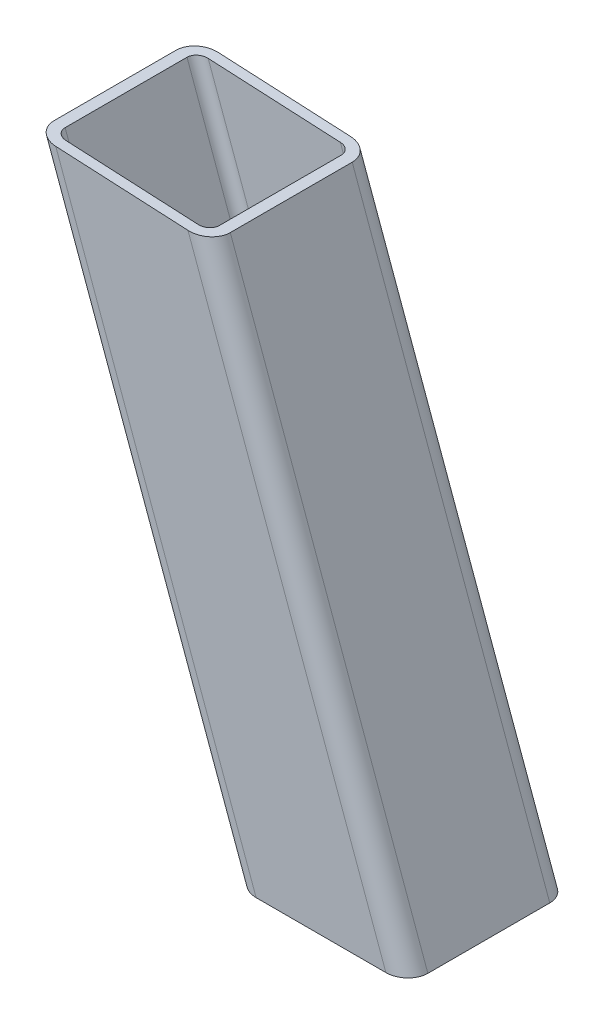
ISO-10303-21;
HEADER;
FILE_DESCRIPTION(('STEP AP214'),'2;1');
FILE_NAME('part.step','',(''),(''),'','','');
FILE_SCHEMA(('AUTOMOTIVE_DESIGN { 1 0 10303 214 1 1 1 1 }'));
ENDSEC;
DATA;
#1=APPLICATION_CONTEXT('core data for automotive mechanical design processes');
#2=APPLICATION_PROTOCOL_DEFINITION('international standard','automotive_design',2000,#1);
#3=PRODUCT_CONTEXT('',#1,'mechanical');
#4=PRODUCT('Part','Part','',(#3));
#5=PRODUCT_RELATED_PRODUCT_CATEGORY('part','',(#4));
#6=PRODUCT_DEFINITION_FORMATION('','',#4);
#7=PRODUCT_DEFINITION_CONTEXT('part definition',#1,'design');
#8=PRODUCT_DEFINITION('design','',#6,#7);
#9=PRODUCT_DEFINITION_SHAPE('','',#8);
#10=(LENGTH_UNIT() NAMED_UNIT(*) SI_UNIT(.MILLI.,.METRE.));
#11=(NAMED_UNIT(*) PLANE_ANGLE_UNIT() SI_UNIT($,.RADIAN.));
#12=(NAMED_UNIT(*) SI_UNIT($,.STERADIAN.) SOLID_ANGLE_UNIT());
#13=UNCERTAINTY_MEASURE_WITH_UNIT(LENGTH_MEASURE(1.E-05),#10,'distance_accuracy_value','');
#14=(GEOMETRIC_REPRESENTATION_CONTEXT(3) GLOBAL_UNCERTAINTY_ASSIGNED_CONTEXT((#13)) GLOBAL_UNIT_ASSIGNED_CONTEXT((#10,
#11,#12)) REPRESENTATION_CONTEXT('',''));
#15=CARTESIAN_POINT('',(0.,0.,0.));
#16=DIRECTION('',(0.,0.,1.));
#17=DIRECTION('',(1.,0.,0.));
#18=AXIS2_PLACEMENT_3D('',#15,#16,#17);
#19=CARTESIAN_POINT('',(937.587704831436,13.6808057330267,30.));
#20=DIRECTION('',(-0.939692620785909,-0.342020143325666,0.));
#21=DIRECTION('',(0.342020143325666,-0.939692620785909,0.));
#22=AXIS2_PLACEMENT_3D('',#19,#20,#21);
#23=PLANE('',#22);
#24=DIRECTION('',(0.,0.,1.));
#25=VECTOR('',#24,1.);
#26=CARTESIAN_POINT('',(921.820807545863,56.9999999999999,30.0000000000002));
#27=LINE('',#26,#25);
#28=CARTESIAN_POINT('',(921.820807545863,57.0000000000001,-30.));
#29=VERTEX_POINT('',#28);
#30=CARTESIAN_POINT('',(921.820807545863,56.9999999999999,30.));
#31=VERTEX_POINT('',#30);
#32=EDGE_CURVE('E53',#29,#31,#27,.T.);
#33=ORIENTED_EDGE('',*,*,#32,.F.);
#34=DIRECTION('',(-0.342020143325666,0.939692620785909,0.));
#35=VECTOR('',#34,1.);
#36=CARTESIAN_POINT('',(937.587704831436,13.6808057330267,-30.));
#37=LINE('',#36,#35);
#38=CARTESIAN_POINT('',(824.604054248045,324.100834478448,-30.));
#39=VERTEX_POINT('',#38);
#40=EDGE_CURVE('E38',#29,#39,#37,.T.);
#41=ORIENTED_EDGE('',*,*,#40,.T.);
#42=DIRECTION('',(0.,0.,-1.));
#43=VECTOR('',#42,1.);
#44=CARTESIAN_POINT('',(824.604054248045,324.100834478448,30.));
#45=LINE('',#44,#43);
#46=CARTESIAN_POINT('',(824.604054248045,324.100834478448,30.));
#47=VERTEX_POINT('',#46);
#48=EDGE_CURVE('E107',#47,#39,#45,.T.);
#49=ORIENTED_EDGE('',*,*,#48,.F.);
#50=DIRECTION('',(-0.342020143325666,0.939692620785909,0.));
#51=VECTOR('',#50,1.);
#52=CARTESIAN_POINT('',(937.587704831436,13.6808057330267,30.));
#53=LINE('',#52,#51);
#54=EDGE_CURVE('E185',#31,#47,#53,.T.);
#55=ORIENTED_EDGE('',*,*,#54,.F.);
#56=EDGE_LOOP('',(#33,#41,#49,#55));
#57=FACE_BOUND('',#56,.T.);
#58=ADVANCED_FACE('F34',(#57),#23,.F.);
#59=CARTESIAN_POINT('',(928.190778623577,10.26060429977,-30.));
#60=DIRECTION('',(-0.342020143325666,0.939692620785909,0.));
#61=DIRECTION('',(-0.939692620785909,-0.342020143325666,0.));
#62=AXIS2_PLACEMENT_3D('',#59,#60,#61);
#63=CYLINDRICAL_SURFACE('',#62,10.);
#64=CARTESIAN_POINT('',(911.179029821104,57.0000000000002,-30.));
#65=DIRECTION('',(0.,-1.,0.));
#66=DIRECTION('',(-1.,0.,0.));
#67=AXIS2_PLACEMENT_3D('',#64,#65,#66);
#68=ELLIPSE('',#67,10.6417777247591,10.);
#69=CARTESIAN_POINT('',(911.179029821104,57.0000000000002,-40.));
#70=VERTEX_POINT('',#69);
#71=EDGE_CURVE('E155',#70,#29,#68,.T.);
#72=ORIENTED_EDGE('',*,*,#71,.F.);
#73=DIRECTION('',(-0.342020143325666,0.939692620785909,0.));
#74=VECTOR('',#73,1.);
#75=CARTESIAN_POINT('',(928.190778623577,10.26060429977,-40.));
#76=LINE('',#75,#74);
#77=CARTESIAN_POINT('',(813.764747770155,324.643540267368,-40.));
#78=VERTEX_POINT('',#77);
#79=EDGE_CURVE('E165',#70,#78,#76,.T.);
#80=ORIENTED_EDGE('',*,*,#79,.T.);
#81=CARTESIAN_POINT('',(813.764747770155,324.643540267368,-30.));
#82=DIRECTION('',(0.0500056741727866,0.998748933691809,0.));
#83=DIRECTION('',(-0.998748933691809,0.0500056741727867,0.));
#84=AXIS2_PLACEMENT_3D('',#81,#82,#83);
#85=ELLIPSE('',#84,10.8528841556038,10.);
#86=EDGE_CURVE('E102',#39,#78,#85,.T.);
#87=ORIENTED_EDGE('',*,*,#86,.F.);
#88=ORIENTED_EDGE('',*,*,#40,.F.);
#89=EDGE_LOOP('',(#72,#80,#87,#88));
#90=FACE_BOUND('',#89,.T.);
#91=ADVANCED_FACE('F164',(#90),#63,.T.);
#92=CARTESIAN_POINT('',(871.809221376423,-10.26060429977,-40.));
#93=DIRECTION('',(0.,0.,1.));
#94=DIRECTION('',(1.,0.,0.));
#95=AXIS2_PLACEMENT_3D('',#92,#93,#94);
#96=PLANE('',#95);
#97=DIRECTION('',(1.,0.,0.));
#98=VECTOR('',#97,1.);
#99=CARTESIAN_POINT('',(871.809221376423,57.0000000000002,-40.));
#100=LINE('',#99,#98);
#101=CARTESIAN_POINT('',(847.328363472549,57.0000000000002,-40.));
#102=VERTEX_POINT('',#101);
#103=EDGE_CURVE('E152',#102,#70,#100,.T.);
#104=ORIENTED_EDGE('',*,*,#103,.F.);
#105=DIRECTION('',(-0.342020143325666,0.939692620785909,0.));
#106=VECTOR('',#105,1.);
#107=CARTESIAN_POINT('',(871.809221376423,-10.26060429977,-40.));
#108=LINE('',#107,#106);
#109=CARTESIAN_POINT('',(748.728908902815,327.899775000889,-40.));
#110=VERTEX_POINT('',#109);
#111=EDGE_CURVE('E170',#102,#110,#108,.T.);
#112=ORIENTED_EDGE('',*,*,#111,.T.);
#113=DIRECTION('',(-0.998748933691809,0.0500056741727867,0.));
#114=VECTOR('',#113,1.);
#115=CARTESIAN_POINT('',(888.390233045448,320.907168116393,-40.));
#116=LINE('',#115,#114);
#117=EDGE_CURVE('E169',#78,#110,#116,.T.);
#118=ORIENTED_EDGE('',*,*,#117,.F.);
#119=ORIENTED_EDGE('',*,*,#79,.F.);
#120=EDGE_LOOP('',(#104,#112,#118,#119));
#121=FACE_BOUND('',#120,.T.);
#122=ADVANCED_FACE('F168',(#121),#96,.F.);
#123=CARTESIAN_POINT('',(871.809221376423,-10.26060429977,-30.));
#124=DIRECTION('',(-0.342020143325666,0.939692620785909,0.));
#125=DIRECTION('',(-0.939692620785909,-0.342020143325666,0.));
#126=AXIS2_PLACEMENT_3D('',#123,#124,#125);
#127=CYLINDRICAL_SURFACE('',#126,10.);
#128=CARTESIAN_POINT('',(847.328363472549,57.0000000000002,-30.));
#129=DIRECTION('',(0.,-1.,0.));
#130=DIRECTION('',(-1.,0.,0.));
#131=AXIS2_PLACEMENT_3D('',#128,#129,#130);
#132=ELLIPSE('',#131,10.6417777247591,10.);
#133=CARTESIAN_POINT('',(836.68658574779,57.0000000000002,-30.));
#134=VERTEX_POINT('',#133);
#135=EDGE_CURVE('E150',#134,#102,#132,.T.);
#136=ORIENTED_EDGE('',*,*,#135,.F.);
#137=DIRECTION('',(-0.342020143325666,0.939692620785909,0.));
#138=VECTOR('',#137,1.);
#139=CARTESIAN_POINT('',(862.412295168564,-13.6808057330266,-30.));
#140=LINE('',#139,#138);
#141=CARTESIAN_POINT('',(737.889602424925,328.442480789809,-30.));
#142=VERTEX_POINT('',#141);
#143=EDGE_CURVE('E171',#134,#142,#140,.T.);
#144=ORIENTED_EDGE('',*,*,#143,.T.);
#145=CARTESIAN_POINT('',(748.728908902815,327.899775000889,-30.));
#146=DIRECTION('',(0.0500056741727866,0.998748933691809,0.));
#147=DIRECTION('',(-0.998748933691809,0.0500056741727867,0.));
#148=AXIS2_PLACEMENT_3D('',#145,#146,#147);
#149=ELLIPSE('',#148,10.8528841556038,10.);
#150=EDGE_CURVE('E228',#110,#142,#149,.T.);
#151=ORIENTED_EDGE('',*,*,#150,.F.);
#152=ORIENTED_EDGE('',*,*,#111,.F.);
#153=EDGE_LOOP('',(#136,#144,#151,#152));
#154=FACE_BOUND('',#153,.T.);
#155=ADVANCED_FACE('F325',(#154),#127,.T.);
#156=CARTESIAN_POINT('',(862.412295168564,-13.6808057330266,-30.));
#157=DIRECTION('',(0.939692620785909,0.342020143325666,0.));
#158=DIRECTION('',(-0.342020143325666,0.939692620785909,0.));
#159=AXIS2_PLACEMENT_3D('',#156,#157,#158);
#160=PLANE('',#159);
#161=DIRECTION('',(0.,0.,-1.));
#162=VECTOR('',#161,1.);
#163=CARTESIAN_POINT('',(836.68658574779,57.0000000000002,-29.9999999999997));
#164=LINE('',#163,#162);
#165=CARTESIAN_POINT('',(836.68658574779,56.9999999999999,30.));
#166=VERTEX_POINT('',#165);
#167=EDGE_CURVE('E253',#166,#134,#164,.T.);
#168=ORIENTED_EDGE('',*,*,#167,.F.);
#169=DIRECTION('',(-0.342020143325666,0.939692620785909,0.));
#170=VECTOR('',#169,1.);
#171=CARTESIAN_POINT('',(862.412295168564,-13.6808057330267,30.));
#172=LINE('',#171,#170);
#173=CARTESIAN_POINT('',(737.889602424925,328.442480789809,30.));
#174=VERTEX_POINT('',#173);
#175=EDGE_CURVE('E176',#166,#174,#172,.T.);
#176=ORIENTED_EDGE('',*,*,#175,.T.);
#177=DIRECTION('',(0.,0.,1.));
#178=VECTOR('',#177,1.);
#179=CARTESIAN_POINT('',(737.889602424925,328.442480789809,-30.0000000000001));
#180=LINE('',#179,#178);
#181=EDGE_CURVE('E230',#142,#174,#180,.T.);
#182=ORIENTED_EDGE('',*,*,#181,.F.);
#183=ORIENTED_EDGE('',*,*,#143,.F.);
#184=EDGE_LOOP('',(#168,#176,#182,#183));
#185=FACE_BOUND('',#184,.T.);
#186=ADVANCED_FACE('F328',(#185),#160,.F.);
#187=CARTESIAN_POINT('',(871.809221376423,-10.2606042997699,30.));
#188=DIRECTION('',(-0.342020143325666,0.939692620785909,0.));
#189=DIRECTION('',(-0.939692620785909,-0.342020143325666,0.));
#190=AXIS2_PLACEMENT_3D('',#187,#188,#189);
#191=CYLINDRICAL_SURFACE('',#190,10.);
#192=CARTESIAN_POINT('',(847.328363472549,56.9999999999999,30.));
#193=DIRECTION('',(0.,-1.,0.));
#194=DIRECTION('',(-1.,0.,0.));
#195=AXIS2_PLACEMENT_3D('',#192,#193,#194);
#196=ELLIPSE('',#195,10.6417777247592,10.);
#197=CARTESIAN_POINT('',(847.328363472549,56.9999999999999,40.));
#198=VERTEX_POINT('',#197);
#199=EDGE_CURVE('E255',#198,#166,#196,.T.);
#200=ORIENTED_EDGE('',*,*,#199,.F.);
#201=DIRECTION('',(-0.342020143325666,0.939692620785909,0.));
#202=VECTOR('',#201,1.);
#203=CARTESIAN_POINT('',(871.809221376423,-10.26060429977,40.));
#204=LINE('',#203,#202);
#205=CARTESIAN_POINT('',(748.728908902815,327.899775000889,40.));
#206=VERTEX_POINT('',#205);
#207=EDGE_CURVE('E179',#198,#206,#204,.T.);
#208=ORIENTED_EDGE('',*,*,#207,.T.);
#209=CARTESIAN_POINT('',(748.728908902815,327.899775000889,30.));
#210=DIRECTION('',(0.0500056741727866,0.998748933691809,0.));
#211=DIRECTION('',(-0.998748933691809,0.0500056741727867,0.));
#212=AXIS2_PLACEMENT_3D('',#209,#210,#211);
#213=ELLIPSE('',#212,10.8528841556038,10.);
#214=EDGE_CURVE('E232',#174,#206,#213,.T.);
#215=ORIENTED_EDGE('',*,*,#214,.F.);
#216=ORIENTED_EDGE('',*,*,#175,.F.);
#217=EDGE_LOOP('',(#200,#208,#215,#216));
#218=FACE_BOUND('',#217,.T.);
#219=ADVANCED_FACE('F332',(#218),#191,.T.);
#220=CARTESIAN_POINT('',(928.190778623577,10.26060429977,40.));
#221=DIRECTION('',(0.,0.,-1.));
#222=DIRECTION('',(-1.,0.,0.));
#223=AXIS2_PLACEMENT_3D('',#220,#221,#222);
#224=PLANE('',#223);
#225=DIRECTION('',(-1.,0.,0.));
#226=VECTOR('',#225,1.);
#227=CARTESIAN_POINT('',(928.190778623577,56.9999999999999,40.));
#228=LINE('',#227,#226);
#229=CARTESIAN_POINT('',(911.179029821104,56.9999999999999,40.));
#230=VERTEX_POINT('',#229);
#231=EDGE_CURVE('E257',#230,#198,#228,.T.);
#232=ORIENTED_EDGE('',*,*,#231,.F.);
#233=DIRECTION('',(-0.342020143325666,0.939692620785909,0.));
#234=VECTOR('',#233,1.);
#235=CARTESIAN_POINT('',(928.190778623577,10.26060429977,40.));
#236=LINE('',#235,#234);
#237=CARTESIAN_POINT('',(813.764747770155,324.643540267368,40.));
#238=VERTEX_POINT('',#237);
#239=EDGE_CURVE('E182',#230,#238,#236,.T.);
#240=ORIENTED_EDGE('',*,*,#239,.T.);
#241=DIRECTION('',(0.998748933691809,-0.0500056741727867,0.));
#242=VECTOR('',#241,1.);
#243=CARTESIAN_POINT('',(943.605911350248,318.142612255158,40.));
#244=LINE('',#243,#242);
#245=EDGE_CURVE('E234',#206,#238,#244,.T.);
#246=ORIENTED_EDGE('',*,*,#245,.F.);
#247=ORIENTED_EDGE('',*,*,#207,.F.);
#248=EDGE_LOOP('',(#232,#240,#246,#247));
#249=FACE_BOUND('',#248,.T.);
#250=ADVANCED_FACE('F335',(#249),#224,.F.);
#251=CARTESIAN_POINT('',(928.190778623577,10.26060429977,30.));
#252=DIRECTION('',(-0.342020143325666,0.939692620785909,0.));
#253=DIRECTION('',(-0.939692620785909,-0.342020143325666,0.));
#254=AXIS2_PLACEMENT_3D('',#251,#252,#253);
#255=CYLINDRICAL_SURFACE('',#254,10.);
#256=CARTESIAN_POINT('',(911.179029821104,56.9999999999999,30.));
#257=DIRECTION('',(0.,-1.,0.));
#258=DIRECTION('',(-1.,0.,0.));
#259=AXIS2_PLACEMENT_3D('',#256,#257,#258);
#260=ELLIPSE('',#259,10.6417777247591,10.);
#261=EDGE_CURVE('E236',#31,#230,#260,.T.);
#262=ORIENTED_EDGE('',*,*,#261,.F.);
#263=ORIENTED_EDGE('',*,*,#54,.T.);
#264=CARTESIAN_POINT('',(813.764747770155,324.643540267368,30.));
#265=DIRECTION('',(0.0500056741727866,0.998748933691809,0.));
#266=DIRECTION('',(-0.998748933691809,0.0500056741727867,0.));
#267=AXIS2_PLACEMENT_3D('',#264,#265,#266);
#268=ELLIPSE('',#267,10.8528841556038,10.);
#269=EDGE_CURVE('E110',#238,#47,#268,.T.);
#270=ORIENTED_EDGE('',*,*,#269,.F.);
#271=ORIENTED_EDGE('',*,*,#239,.F.);
#272=EDGE_LOOP('',(#262,#263,#270,#271));
#273=FACE_BOUND('',#272,.T.);
#274=ADVANCED_FACE('F36',(#273),#255,.T.);
#275=CARTESIAN_POINT('',(6158.08276398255,57.0625533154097,-40.));
#276=DIRECTION('',(0.0500056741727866,0.998748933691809,0.));
#277=DIRECTION('',(-0.998748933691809,0.0500056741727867,0.));
#278=AXIS2_PLACEMENT_3D('',#275,#276,#277);
#279=PLANE('',#278);
#280=DIRECTION('',(0.,0.,1.));
#281=VECTOR('',#280,1.);
#282=CARTESIAN_POINT('',(743.30925566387,328.171127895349,-30.));
#283=LINE('',#282,#281);
#284=CARTESIAN_POINT('',(743.30925566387,328.171127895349,-30.));
#285=VERTEX_POINT('',#284);
#286=CARTESIAN_POINT('',(743.30925566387,328.171127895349,30.));
#287=VERTEX_POINT('',#286);
#288=EDGE_CURVE('E191',#285,#287,#283,.T.);
#289=ORIENTED_EDGE('',*,*,#288,.F.);
#290=CARTESIAN_POINT('',(748.728908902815,327.899775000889,-30.));
#291=DIRECTION('',(0.0500056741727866,0.998748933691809,0.));
#292=DIRECTION('',(-0.998748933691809,0.0500056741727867,0.));
#293=AXIS2_PLACEMENT_3D('',#290,#291,#292);
#294=ELLIPSE('',#293,5.4264420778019,5.00000000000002);
#295=CARTESIAN_POINT('',(748.728908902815,327.899775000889,-35.));
#296=VERTEX_POINT('',#295);
#297=EDGE_CURVE('E196',#296,#285,#294,.T.);
#298=ORIENTED_EDGE('',*,*,#297,.F.);
#299=DIRECTION('',(-0.998748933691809,0.0500056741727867,0.));
#300=VECTOR('',#299,1.);
#301=CARTESIAN_POINT('',(888.390233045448,320.907168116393,-35.));
#302=LINE('',#301,#300);
#303=CARTESIAN_POINT('',(813.764747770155,324.643540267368,-35.));
#304=VERTEX_POINT('',#303);
#305=EDGE_CURVE('E201',#304,#296,#302,.T.);
#306=ORIENTED_EDGE('',*,*,#305,.F.);
#307=CARTESIAN_POINT('',(813.764747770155,324.643540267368,-30.));
#308=DIRECTION('',(0.0500056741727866,0.998748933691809,0.));
#309=DIRECTION('',(-0.998748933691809,0.0500056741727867,0.));
#310=AXIS2_PLACEMENT_3D('',#307,#308,#309);
#311=ELLIPSE('',#310,5.42644207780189,5.00000000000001);
#312=CARTESIAN_POINT('',(819.1844010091,324.372187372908,-30.));
#313=VERTEX_POINT('',#312);
#314=EDGE_CURVE('E206',#313,#304,#311,.T.);
#315=ORIENTED_EDGE('',*,*,#314,.F.);
#316=DIRECTION('',(0.,0.,-1.));
#317=VECTOR('',#316,1.);
#318=CARTESIAN_POINT('',(819.1844010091,324.372187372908,30.));
#319=LINE('',#318,#317);
#320=CARTESIAN_POINT('',(819.1844010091,324.372187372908,30.));
#321=VERTEX_POINT('',#320);
#322=EDGE_CURVE('E211',#321,#313,#319,.T.);
#323=ORIENTED_EDGE('',*,*,#322,.F.);
#324=CARTESIAN_POINT('',(813.764747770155,324.643540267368,30.));
#325=DIRECTION('',(0.0500056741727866,0.998748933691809,0.));
#326=DIRECTION('',(-0.998748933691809,0.0500056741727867,0.));
#327=AXIS2_PLACEMENT_3D('',#324,#325,#326);
#328=ELLIPSE('',#327,5.42644207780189,5.00000000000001);
#329=CARTESIAN_POINT('',(813.764747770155,324.643540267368,35.));
#330=VERTEX_POINT('',#329);
#331=EDGE_CURVE('E216',#330,#321,#328,.T.);
#332=ORIENTED_EDGE('',*,*,#331,.F.);
#333=DIRECTION('',(0.998748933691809,-0.0500056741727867,0.));
#334=VECTOR('',#333,1.);
#335=CARTESIAN_POINT('',(943.605911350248,318.142612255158,35.));
#336=LINE('',#335,#334);
#337=CARTESIAN_POINT('',(748.728908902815,327.899775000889,35.));
#338=VERTEX_POINT('',#337);
#339=EDGE_CURVE('E221',#338,#330,#336,.T.);
#340=ORIENTED_EDGE('',*,*,#339,.F.);
#341=CARTESIAN_POINT('',(748.728908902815,327.899775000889,30.));
#342=DIRECTION('',(0.0500056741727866,0.998748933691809,0.));
#343=DIRECTION('',(-0.998748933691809,0.0500056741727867,0.));
#344=AXIS2_PLACEMENT_3D('',#341,#342,#343);
#345=ELLIPSE('',#344,5.42644207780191,5.00000000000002);
#346=EDGE_CURVE('E11',#287,#338,#345,.T.);
#347=ORIENTED_EDGE('',*,*,#346,.F.);
#348=EDGE_LOOP('',(#289,#298,#306,#315,#323,#332,#340,#347));
#349=FACE_BOUND('',#348,.T.);
#350=ORIENTED_EDGE('',*,*,#269,.T.);
#351=ORIENTED_EDGE('',*,*,#48,.T.);
#352=ORIENTED_EDGE('',*,*,#86,.T.);
#353=ORIENTED_EDGE('',*,*,#117,.T.);
#354=ORIENTED_EDGE('',*,*,#150,.T.);
#355=ORIENTED_EDGE('',*,*,#181,.T.);
#356=ORIENTED_EDGE('',*,*,#214,.T.);
#357=ORIENTED_EDGE('',*,*,#245,.T.);
#358=EDGE_LOOP('',(#350,#351,#352,#353,#354,#355,#356,#357));
#359=FACE_BOUND('',#358,.T.);
#360=ADVANCED_FACE('F286',(#349,#359),#279,.T.);
#361=CARTESIAN_POINT('',(9149.96897120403,57.0000000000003,-59.9999999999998));
#362=DIRECTION('',(0.,-1.,0.));
#363=DIRECTION('',(0.,0.,-1.));
#364=AXIS2_PLACEMENT_3D('',#361,#362,#363);
#365=PLANE('',#364);
#366=DIRECTION('',(-1.,0.,0.));
#367=VECTOR('',#366,1.);
#368=CARTESIAN_POINT('',(928.190778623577,56.9999999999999,35.));
#369=LINE('',#368,#367);
#370=CARTESIAN_POINT('',(911.179029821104,56.9999999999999,35.));
#371=VERTEX_POINT('',#370);
#372=CARTESIAN_POINT('',(847.328363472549,56.9999999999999,35.));
#373=VERTEX_POINT('',#372);
#374=EDGE_CURVE('E222',#371,#373,#369,.T.);
#375=ORIENTED_EDGE('',*,*,#374,.F.);
#376=CARTESIAN_POINT('',(911.179029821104,56.9999999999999,30.));
#377=DIRECTION('',(0.,-1.,0.));
#378=DIRECTION('',(-1.,0.,0.));
#379=AXIS2_PLACEMENT_3D('',#376,#377,#378);
#380=ELLIPSE('',#379,5.32088886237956,5.00000000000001);
#381=CARTESIAN_POINT('',(916.499918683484,56.9999999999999,30.));
#382=VERTEX_POINT('',#381);
#383=EDGE_CURVE('E217',#382,#371,#380,.T.);
#384=ORIENTED_EDGE('',*,*,#383,.F.);
#385=DIRECTION('',(0.,0.,1.));
#386=VECTOR('',#385,1.);
#387=CARTESIAN_POINT('',(916.499918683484,56.9999999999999,30.0000000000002));
#388=LINE('',#387,#386);
#389=CARTESIAN_POINT('',(916.499918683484,57.0000000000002,-30.));
#390=VERTEX_POINT('',#389);
#391=EDGE_CURVE('E212',#390,#382,#388,.T.);
#392=ORIENTED_EDGE('',*,*,#391,.F.);
#393=CARTESIAN_POINT('',(911.179029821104,57.0000000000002,-30.));
#394=DIRECTION('',(0.,-1.,0.));
#395=DIRECTION('',(-1.,0.,0.));
#396=AXIS2_PLACEMENT_3D('',#393,#394,#395);
#397=ELLIPSE('',#396,5.32088886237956,5.00000000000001);
#398=CARTESIAN_POINT('',(911.179029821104,57.0000000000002,-35.));
#399=VERTEX_POINT('',#398);
#400=EDGE_CURVE('E207',#399,#390,#397,.T.);
#401=ORIENTED_EDGE('',*,*,#400,.F.);
#402=DIRECTION('',(1.,0.,0.));
#403=VECTOR('',#402,1.);
#404=CARTESIAN_POINT('',(871.809221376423,57.0000000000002,-35.));
#405=LINE('',#404,#403);
#406=CARTESIAN_POINT('',(847.328363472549,57.0000000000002,-35.));
#407=VERTEX_POINT('',#406);
#408=EDGE_CURVE('E202',#407,#399,#405,.T.);
#409=ORIENTED_EDGE('',*,*,#408,.F.);
#410=CARTESIAN_POINT('',(847.328363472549,57.0000000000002,-30.));
#411=DIRECTION('',(0.,-1.,0.));
#412=DIRECTION('',(-1.,0.,0.));
#413=AXIS2_PLACEMENT_3D('',#410,#411,#412);
#414=ELLIPSE('',#413,5.32088886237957,5.00000000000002);
#415=CARTESIAN_POINT('',(842.00747461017,57.,-30.));
#416=VERTEX_POINT('',#415);
#417=EDGE_CURVE('E197',#416,#407,#414,.T.);
#418=ORIENTED_EDGE('',*,*,#417,.F.);
#419=DIRECTION('',(0.,0.,-1.));
#420=VECTOR('',#419,1.);
#421=CARTESIAN_POINT('',(842.00747461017,57.0000000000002,-29.9999999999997));
#422=LINE('',#421,#420);
#423=CARTESIAN_POINT('',(842.00747461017,56.9999999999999,30.));
#424=VERTEX_POINT('',#423);
#425=EDGE_CURVE('E192',#424,#416,#422,.T.);
#426=ORIENTED_EDGE('',*,*,#425,.F.);
#427=CARTESIAN_POINT('',(847.328363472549,56.9999999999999,30.));
#428=DIRECTION('',(0.,-1.,0.));
#429=DIRECTION('',(-1.,0.,0.));
#430=AXIS2_PLACEMENT_3D('',#427,#428,#429);
#431=ELLIPSE('',#430,5.32088886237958,5.00000000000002);
#432=EDGE_CURVE('E225',#373,#424,#431,.T.);
#433=ORIENTED_EDGE('',*,*,#432,.F.);
#434=EDGE_LOOP('',(#375,#384,#392,#401,#409,#418,#426,#433));
#435=FACE_BOUND('',#434,.T.);
#436=ORIENTED_EDGE('',*,*,#261,.T.);
#437=ORIENTED_EDGE('',*,*,#231,.T.);
#438=ORIENTED_EDGE('',*,*,#199,.T.);
#439=ORIENTED_EDGE('',*,*,#167,.T.);
#440=ORIENTED_EDGE('',*,*,#135,.T.);
#441=ORIENTED_EDGE('',*,*,#103,.T.);
#442=ORIENTED_EDGE('',*,*,#71,.T.);
#443=ORIENTED_EDGE('',*,*,#32,.T.);
#444=EDGE_LOOP('',(#436,#437,#438,#439,#440,#441,#442,#443));
#445=FACE_BOUND('',#444,.T.);
#446=ADVANCED_FACE('F154',(#435,#445),#365,.T.);
#447=CARTESIAN_POINT('',(867.110758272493,-11.9707050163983,-30.));
#448=DIRECTION('',(0.939692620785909,0.342020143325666,0.));
#449=DIRECTION('',(-0.342020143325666,0.939692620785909,0.));
#450=AXIS2_PLACEMENT_3D('',#447,#448,#449);
#451=PLANE('',#450);
#452=DIRECTION('',(-0.342020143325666,0.939692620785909,0.));
#453=VECTOR('',#452,1.);
#454=CARTESIAN_POINT('',(867.110758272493,-11.9707050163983,30.));
#455=LINE('',#454,#453);
#456=EDGE_CURVE('E44',#424,#287,#455,.T.);
#457=ORIENTED_EDGE('',*,*,#456,.F.);
#458=ORIENTED_EDGE('',*,*,#425,.T.);
#459=DIRECTION('',(-0.342020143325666,0.939692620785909,0.));
#460=VECTOR('',#459,1.);
#461=CARTESIAN_POINT('',(867.110758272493,-11.9707050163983,-30.));
#462=LINE('',#461,#460);
#463=EDGE_CURVE('E188',#416,#285,#462,.T.);
#464=ORIENTED_EDGE('',*,*,#463,.T.);
#465=ORIENTED_EDGE('',*,*,#288,.T.);
#466=EDGE_LOOP('',(#457,#458,#464,#465));
#467=FACE_BOUND('',#466,.T.);
#468=ADVANCED_FACE('F283',(#467),#451,.T.);
#469=CARTESIAN_POINT('',(871.809221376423,-10.26060429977,-30.));
#470=DIRECTION('',(-0.342020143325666,0.939692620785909,0.));
#471=DIRECTION('',(-0.939692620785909,-0.342020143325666,0.));
#472=AXIS2_PLACEMENT_3D('',#469,#470,#471);
#473=CYLINDRICAL_SURFACE('',#472,5.00000000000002);
#474=ORIENTED_EDGE('',*,*,#463,.F.);
#475=ORIENTED_EDGE('',*,*,#417,.T.);
#476=DIRECTION('',(-0.342020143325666,0.939692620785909,0.));
#477=VECTOR('',#476,1.);
#478=CARTESIAN_POINT('',(871.809221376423,-10.26060429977,-35.));
#479=LINE('',#478,#477);
#480=EDGE_CURVE('E193',#407,#296,#479,.T.);
#481=ORIENTED_EDGE('',*,*,#480,.T.);
#482=ORIENTED_EDGE('',*,*,#297,.T.);
#483=EDGE_LOOP('',(#474,#475,#481,#482));
#484=FACE_BOUND('',#483,.T.);
#485=ADVANCED_FACE('F288',(#484),#473,.F.);
#486=CARTESIAN_POINT('',(871.809221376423,-10.26060429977,-35.));
#487=DIRECTION('',(0.,0.,1.));
#488=DIRECTION('',(1.,0.,0.));
#489=AXIS2_PLACEMENT_3D('',#486,#487,#488);
#490=PLANE('',#489);
#491=ORIENTED_EDGE('',*,*,#480,.F.);
#492=ORIENTED_EDGE('',*,*,#408,.T.);
#493=DIRECTION('',(-0.342020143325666,0.939692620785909,0.));
#494=VECTOR('',#493,1.);
#495=CARTESIAN_POINT('',(928.190778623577,10.26060429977,-35.));
#496=LINE('',#495,#494);
#497=EDGE_CURVE('E198',#399,#304,#496,.T.);
#498=ORIENTED_EDGE('',*,*,#497,.T.);
#499=ORIENTED_EDGE('',*,*,#305,.T.);
#500=EDGE_LOOP('',(#491,#492,#498,#499));
#501=FACE_BOUND('',#500,.T.);
#502=ADVANCED_FACE('F292',(#501),#490,.T.);
#503=CARTESIAN_POINT('',(928.190778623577,10.26060429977,-30.));
#504=DIRECTION('',(-0.342020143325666,0.939692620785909,0.));
#505=DIRECTION('',(-0.939692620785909,-0.342020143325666,0.));
#506=AXIS2_PLACEMENT_3D('',#503,#504,#505);
#507=CYLINDRICAL_SURFACE('',#506,5.00000000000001);
#508=ORIENTED_EDGE('',*,*,#497,.F.);
#509=ORIENTED_EDGE('',*,*,#400,.T.);
#510=DIRECTION('',(-0.342020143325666,0.939692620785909,0.));
#511=VECTOR('',#510,1.);
#512=CARTESIAN_POINT('',(932.889241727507,11.9707050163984,-30.));
#513=LINE('',#512,#511);
#514=EDGE_CURVE('E203',#390,#313,#513,.T.);
#515=ORIENTED_EDGE('',*,*,#514,.T.);
#516=ORIENTED_EDGE('',*,*,#314,.T.);
#517=EDGE_LOOP('',(#508,#509,#515,#516));
#518=FACE_BOUND('',#517,.T.);
#519=ADVANCED_FACE('F295',(#518),#507,.F.);
#520=CARTESIAN_POINT('',(932.889241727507,11.9707050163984,30.));
#521=DIRECTION('',(-0.939692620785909,-0.342020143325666,0.));
#522=DIRECTION('',(0.342020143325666,-0.939692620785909,0.));
#523=AXIS2_PLACEMENT_3D('',#520,#521,#522);
#524=PLANE('',#523);
#525=ORIENTED_EDGE('',*,*,#514,.F.);
#526=ORIENTED_EDGE('',*,*,#391,.T.);
#527=DIRECTION('',(-0.342020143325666,0.939692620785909,0.));
#528=VECTOR('',#527,1.);
#529=CARTESIAN_POINT('',(932.889241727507,11.9707050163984,30.));
#530=LINE('',#529,#528);
#531=EDGE_CURVE('E208',#382,#321,#530,.T.);
#532=ORIENTED_EDGE('',*,*,#531,.T.);
#533=ORIENTED_EDGE('',*,*,#322,.T.);
#534=EDGE_LOOP('',(#525,#526,#532,#533));
#535=FACE_BOUND('',#534,.T.);
#536=ADVANCED_FACE('F298',(#535),#524,.T.);
#537=CARTESIAN_POINT('',(928.190778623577,10.26060429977,30.));
#538=DIRECTION('',(-0.342020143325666,0.939692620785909,0.));
#539=DIRECTION('',(-0.939692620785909,-0.342020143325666,0.));
#540=AXIS2_PLACEMENT_3D('',#537,#538,#539);
#541=CYLINDRICAL_SURFACE('',#540,5.00000000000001);
#542=ORIENTED_EDGE('',*,*,#531,.F.);
#543=ORIENTED_EDGE('',*,*,#383,.T.);
#544=DIRECTION('',(-0.342020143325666,0.939692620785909,0.));
#545=VECTOR('',#544,1.);
#546=CARTESIAN_POINT('',(928.190778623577,10.26060429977,35.));
#547=LINE('',#546,#545);
#548=EDGE_CURVE('E213',#371,#330,#547,.T.);
#549=ORIENTED_EDGE('',*,*,#548,.T.);
#550=ORIENTED_EDGE('',*,*,#331,.T.);
#551=EDGE_LOOP('',(#542,#543,#549,#550));
#552=FACE_BOUND('',#551,.T.);
#553=ADVANCED_FACE('F301',(#552),#541,.F.);
#554=CARTESIAN_POINT('',(928.190778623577,10.26060429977,35.));
#555=DIRECTION('',(0.,0.,-1.));
#556=DIRECTION('',(-1.,0.,0.));
#557=AXIS2_PLACEMENT_3D('',#554,#555,#556);
#558=PLANE('',#557);
#559=ORIENTED_EDGE('',*,*,#548,.F.);
#560=ORIENTED_EDGE('',*,*,#374,.T.);
#561=DIRECTION('',(-0.342020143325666,0.939692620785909,0.));
#562=VECTOR('',#561,1.);
#563=CARTESIAN_POINT('',(871.809221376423,-10.26060429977,35.));
#564=LINE('',#563,#562);
#565=EDGE_CURVE('E218',#373,#338,#564,.T.);
#566=ORIENTED_EDGE('',*,*,#565,.T.);
#567=ORIENTED_EDGE('',*,*,#339,.T.);
#568=EDGE_LOOP('',(#559,#560,#566,#567));
#569=FACE_BOUND('',#568,.T.);
#570=ADVANCED_FACE('F304',(#569),#558,.T.);
#571=CARTESIAN_POINT('',(871.809221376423,-10.2606042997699,30.));
#572=DIRECTION('',(-0.342020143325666,0.939692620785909,0.));
#573=DIRECTION('',(-0.939692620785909,-0.342020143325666,0.));
#574=AXIS2_PLACEMENT_3D('',#571,#572,#573);
#575=CYLINDRICAL_SURFACE('',#574,5.00000000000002);
#576=ORIENTED_EDGE('',*,*,#565,.F.);
#577=ORIENTED_EDGE('',*,*,#432,.T.);
#578=ORIENTED_EDGE('',*,*,#456,.T.);
#579=ORIENTED_EDGE('',*,*,#346,.T.);
#580=EDGE_LOOP('',(#576,#577,#578,#579));
#581=FACE_BOUND('',#580,.T.);
#582=ADVANCED_FACE('F280',(#581),#575,.F.);
#583=CLOSED_SHELL('',(#58,#91,#122,#155,#186,#219,#250,#274,#360,#446,#468,#485,#502,#519,#536,
#553,#570,#582));
#584=MANIFOLD_SOLID_BREP('B2',#583);
#585=ADVANCED_BREP_SHAPE_REPRESENTATION('',(#18,#584),#14);
#586=SHAPE_DEFINITION_REPRESENTATION(#9,#585);
ENDSEC;
END-ISO-10303-21;
